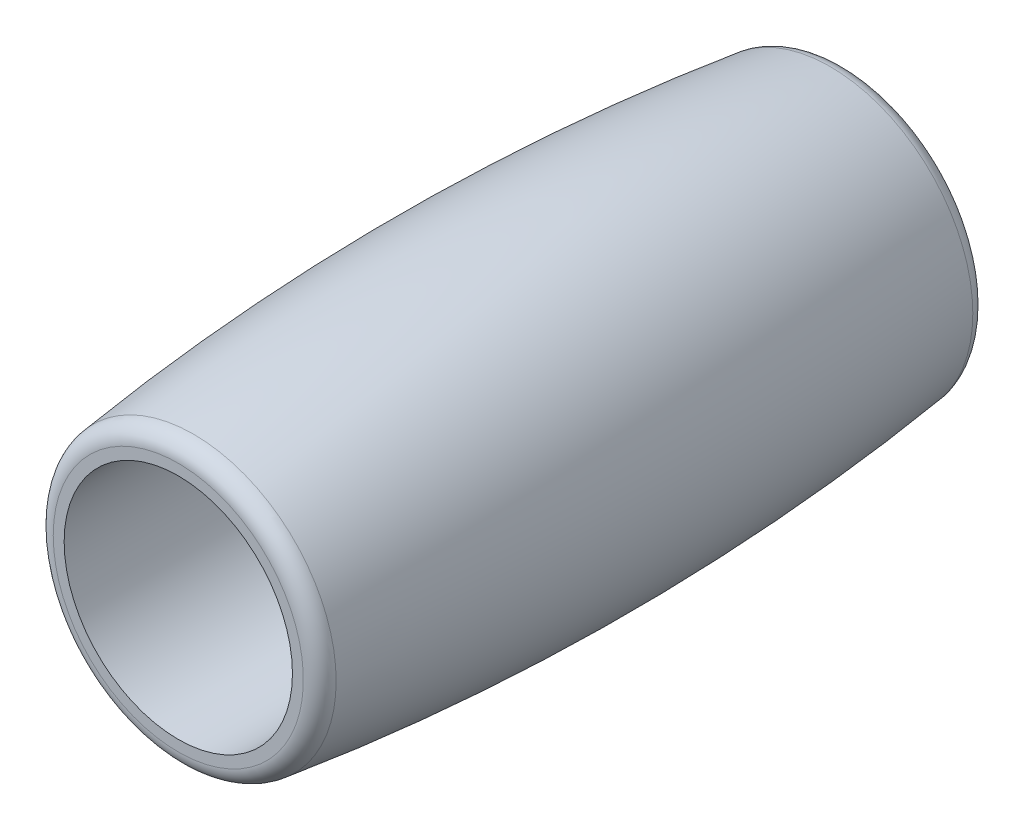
from build123d import *

# Parameters (mm, degrees)
FILLET_1_R = 1
FILLET_2_R = 1


with BuildPart() as part:
    # Sketch 1 → Revolve 1 (revolve)
    with BuildSketch(Plane(origin=(0, 0, 0), x_dir=(1, 0, 0), z_dir=(0, 1, 0)), mode=Mode.PRIVATE) as revolve_1_sk:
        with BuildLine():
            Line((8, 19.597114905), (6.5, 19.597114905))
            Line((6.5, 19.597114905), (6.5, -18.402885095))
            Line((6.5, -18.402885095), (8, -18.402885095))
            ThreePointArc((8, -18.402885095), (9.25, 0.597114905), (8, 19.597114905))
        make_face()
    revolve(revolve_1_sk.sketch.rotate(Axis((0, 0, -17.560419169), (0, 0, 1)), 180), axis=Axis((0, 0, -17.560419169), (0, 0, 1)))

    # Fillet 1
    fillet_1_edges = [part.edges().sort_by_distance(p)[0] for p in [
        (8, 0, 18.402885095),
    ]]
    fillet(fillet_1_edges, radius=FILLET_1_R)

    # Fillet 2
    fillet_2_edges = [part.edges().sort_by_distance(p)[0] for p in [
        (8, 0, -19.597114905),
    ]]
    fillet(fillet_2_edges, radius=FILLET_2_R)


solid = part.part
